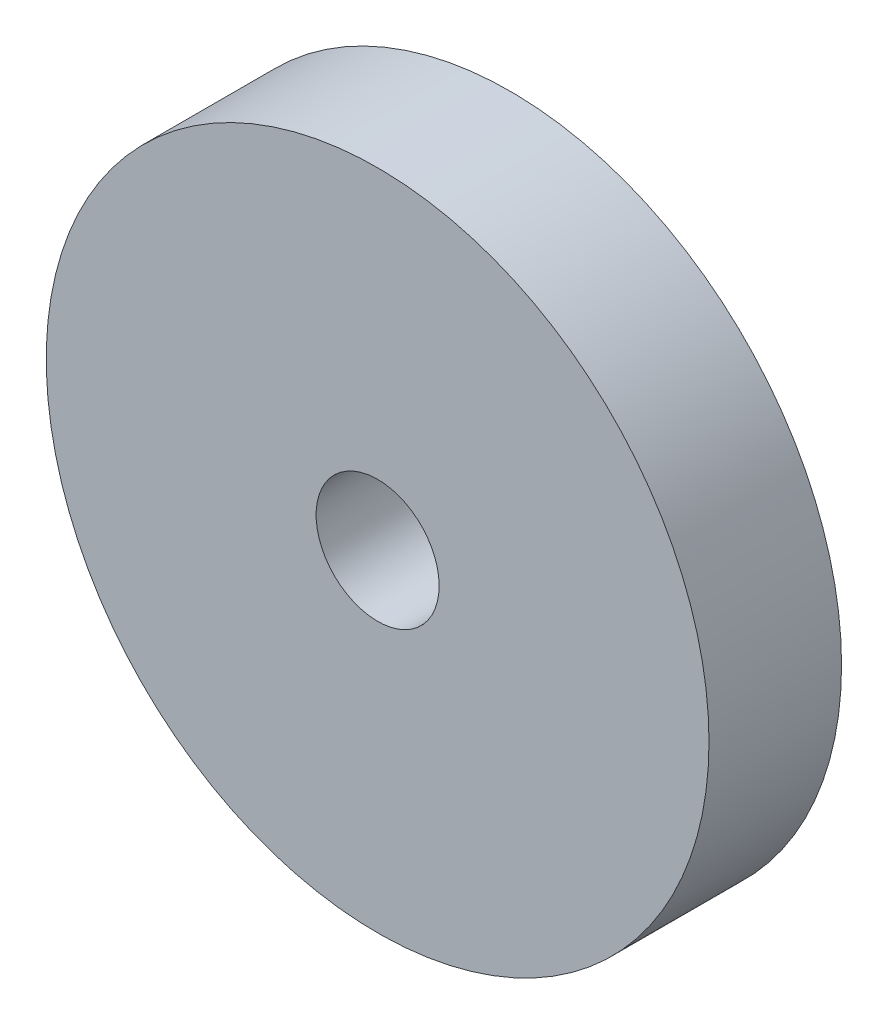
from build123d import *

# Parameters (mm, degrees)
SKETCH1_R             = 7.9375
BOSS_EXTRUDE1_DEPTH   = 3.175
F_4_CLEARANCE_HOLE1_D = 2.9464


with BuildPart() as part:
    # Sketch1 → Boss-Extrude1 (new body)
    with BuildSketch(Plane.XY):
        Circle(SKETCH1_R)
    extrude(amount=BOSS_EXTRUDE1_DEPTH)

    # 4 Clearance Hole1 (through all)
    with Locations(Plane.XY.offset(3.175)):
        with Locations((0, 0)):
            Hole(F_4_CLEARANCE_HOLE1_D / 2)


solid = part.part
